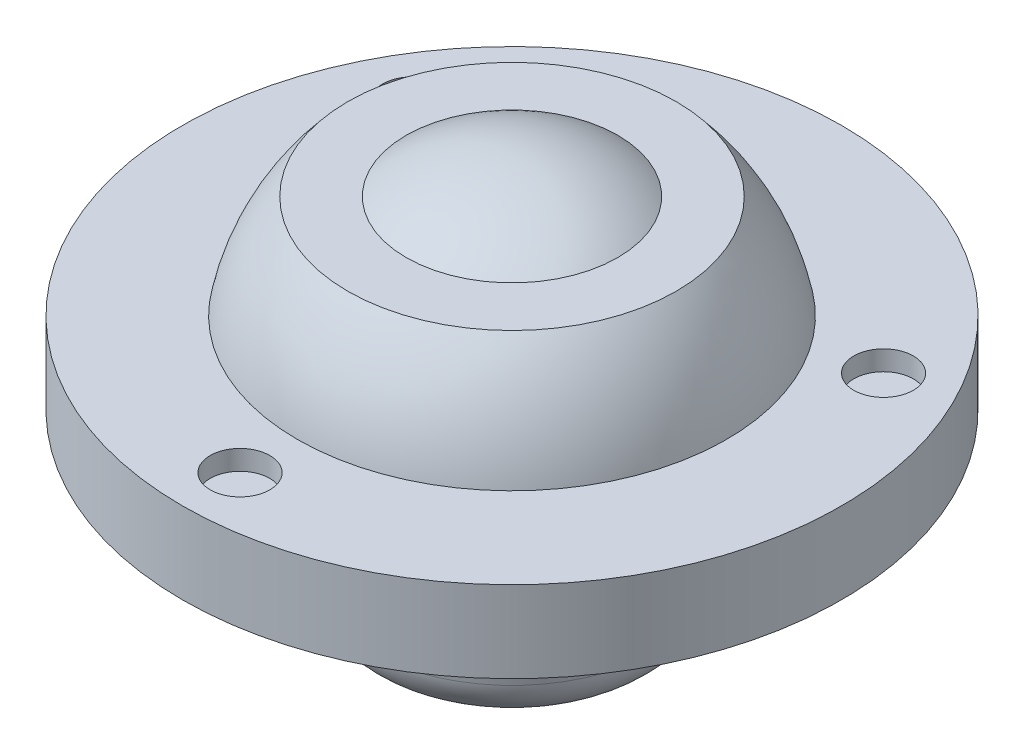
ISO-10303-21;
HEADER;
FILE_DESCRIPTION(('STEP AP214'),'2;1');
FILE_NAME('part.step','',(''),(''),'','','');
FILE_SCHEMA(('AUTOMOTIVE_DESIGN { 1 0 10303 214 1 1 1 1 }'));
ENDSEC;
DATA;
#1=APPLICATION_CONTEXT('core data for automotive mechanical design processes');
#2=APPLICATION_PROTOCOL_DEFINITION('international standard','automotive_design',2000,#1);
#3=PRODUCT_CONTEXT('',#1,'mechanical');
#4=PRODUCT('Part','Part','',(#3));
#5=PRODUCT_RELATED_PRODUCT_CATEGORY('part','',(#4));
#6=PRODUCT_DEFINITION_FORMATION('','',#4);
#7=PRODUCT_DEFINITION_CONTEXT('part definition',#1,'design');
#8=PRODUCT_DEFINITION('design','',#6,#7);
#9=PRODUCT_DEFINITION_SHAPE('','',#8);
#10=(LENGTH_UNIT() NAMED_UNIT(*) SI_UNIT(.MILLI.,.METRE.));
#11=(NAMED_UNIT(*) PLANE_ANGLE_UNIT() SI_UNIT($,.RADIAN.));
#12=(NAMED_UNIT(*) SI_UNIT($,.STERADIAN.) SOLID_ANGLE_UNIT());
#13=UNCERTAINTY_MEASURE_WITH_UNIT(LENGTH_MEASURE(1.E-05),#10,'distance_accuracy_value','');
#14=(GEOMETRIC_REPRESENTATION_CONTEXT(3) GLOBAL_UNCERTAINTY_ASSIGNED_CONTEXT((#13)) GLOBAL_UNIT_ASSIGNED_CONTEXT((#10,
#11,#12)) REPRESENTATION_CONTEXT('',''));
#15=CARTESIAN_POINT('',(0.,0.,0.));
#16=DIRECTION('',(0.,0.,1.));
#17=DIRECTION('',(1.,0.,0.));
#18=AXIS2_PLACEMENT_3D('',#15,#16,#17);
#19=CARTESIAN_POINT('',(0.,-11.,4.92833956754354));
#20=DIRECTION('',(0.,-1.,0.));
#21=DIRECTION('',(0.,0.,-1.));
#22=AXIS2_PLACEMENT_3D('',#19,#20,#21);
#23=PLANE('',#22);
#24=CARTESIAN_POINT('',(0.,-11.,0.));
#25=DIRECTION('',(0.,1.,0.));
#26=DIRECTION('',(0.,0.,1.));
#27=AXIS2_PLACEMENT_3D('',#24,#25,#26);
#28=CIRCLE('',#27,4.92833956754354);
#29=CARTESIAN_POINT('',(0.,-11.,4.92833956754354));
#30=VERTEX_POINT('',#29);
#31=EDGE_CURVE('E78',#30,#30,#28,.T.);
#32=ORIENTED_EDGE('',*,*,#31,.F.);
#33=EDGE_LOOP('',(#32));
#34=FACE_BOUND('',#33,.T.);
#35=ADVANCED_FACE('F30',(#34),#23,.T.);
#36=CARTESIAN_POINT('',(0.,0.,0.));
#37=DIRECTION('',(0.,1.,0.));
#38=DIRECTION('',(0.,0.,-1.));
#39=AXIS2_PLACEMENT_3D('',#36,#37,#38);
#40=SPHERICAL_SURFACE('',#39,9.);
#41=CARTESIAN_POINT('',(0.,7.24999999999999,0.));
#42=DIRECTION('',(0.,1.,0.));
#43=DIRECTION('',(0.,0.,1.));
#44=AXIS2_PLACEMENT_3D('',#41,#42,#43);
#45=CIRCLE('',#44,5.33268225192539);
#46=CARTESIAN_POINT('',(0.,7.24999999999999,5.33268225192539));
#47=VERTEX_POINT('',#46);
#48=EDGE_CURVE('E105',#47,#47,#45,.T.);
#49=ORIENTED_EDGE('',*,*,#48,.T.);
#50=EDGE_LOOP('',(#49));
#51=FACE_BOUND('',#50,.T.);
#52=ADVANCED_FACE('F188',(#51),#40,.T.);
#53=CARTESIAN_POINT('',(0.,7.25,7.806247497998));
#54=DIRECTION('',(0.,1.,0.));
#55=DIRECTION('',(0.,0.,1.));
#56=AXIS2_PLACEMENT_3D('',#53,#54,#55);
#57=PLANE('',#56);
#58=CARTESIAN_POINT('',(0.,7.24999999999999,0.));
#59=DIRECTION('',(0.,1.,0.));
#60=DIRECTION('',(0.,0.,1.));
#61=AXIS2_PLACEMENT_3D('',#58,#59,#60);
#62=CIRCLE('',#61,8.27269605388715);
#63=CARTESIAN_POINT('',(0.,7.24999999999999,8.27269605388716));
#64=VERTEX_POINT('',#63);
#65=EDGE_CURVE('E102',#64,#64,#62,.T.);
#66=ORIENTED_EDGE('',*,*,#65,.T.);
#67=EDGE_LOOP('',(#66));
#68=FACE_BOUND('',#67,.T.);
#69=ORIENTED_EDGE('',*,*,#48,.F.);
#70=EDGE_LOOP('',(#69));
#71=FACE_BOUND('',#70,.T.);
#72=ADVANCED_FACE('F193',(#68,#71),#57,.T.);
#73=CARTESIAN_POINT('',(0.,0.,0.));
#74=DIRECTION('',(0.,1.,0.));
#75=DIRECTION('',(0.,0.,1.));
#76=AXIS2_PLACEMENT_3D('',#73,#74,#75);
#77=SPHERICAL_SURFACE('',#76,11.);
#78=CARTESIAN_POINT('',(0.,2.05,0.));
#79=DIRECTION('',(0.,1.,0.));
#80=DIRECTION('',(0.,0.,1.));
#81=AXIS2_PLACEMENT_3D('',#78,#79,#80);
#82=CIRCLE('',#81,10.807289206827);
#83=CARTESIAN_POINT('',(0.,2.05,10.807289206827));
#84=VERTEX_POINT('',#83);
#85=EDGE_CURVE('E99',#84,#84,#82,.T.);
#86=CARTESIAN_POINT('',(0.,2.05,10.807289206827));
#87=CARTESIAN_POINT('',(0.,2.10990725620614,10.7959256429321));
#88=CARTESIAN_POINT('',(0.,2.16972000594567,10.7840638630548));
#89=CARTESIAN_POINT('',(0.,2.28913999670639,10.7593473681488));
#90=CARTESIAN_POINT('',(0.,2.34874723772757,10.7464926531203));
#91=CARTESIAN_POINT('',(0.,2.46773971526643,10.7197937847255));
#92=CARTESIAN_POINT('',(0.,2.52712495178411,10.7059496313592));
#93=CARTESIAN_POINT('',(0.,2.64565700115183,10.677275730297));
#94=CARTESIAN_POINT('',(0.,2.70480381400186,10.662445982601));
#95=CARTESIAN_POINT('',(0.,2.82284265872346,10.6318049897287));
#96=CARTESIAN_POINT('',(0.,2.88173469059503,10.6159937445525));
#97=CARTESIAN_POINT('',(0.,2.99924768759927,10.5833941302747));
#98=CARTESIAN_POINT('',(0.,3.05786865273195,10.5666057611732));
#99=CARTESIAN_POINT('',(0.,3.17482330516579,10.5320565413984));
#100=CARTESIAN_POINT('',(0.,3.23315699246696,10.5142956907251));
#101=CARTESIAN_POINT('',(0.,3.34952095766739,10.477806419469));
#102=CARTESIAN_POINT('',(0.,3.40755123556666,10.4590779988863));
#103=CARTESIAN_POINT('',(0.,3.52329233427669,10.4206587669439));
#104=CARTESIAN_POINT('',(0.,3.58100315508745,10.4009679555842));
#105=CARTESIAN_POINT('',(0.,3.69608938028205,10.360629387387));
#106=CARTESIAN_POINT('',(0.,3.7534647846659,10.3399816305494));
#107=CARTESIAN_POINT('',(0.,3.86786431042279,10.2977348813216));
#108=CARTESIAN_POINT('',(0.,3.92488843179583,10.2761358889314));
#109=CARTESIAN_POINT('',(0.,4.03856962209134,10.2319926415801));
#110=CARTESIAN_POINT('',(0.,4.09522669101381,10.209448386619));
#111=CARTESIAN_POINT('',(0.,4.20815810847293,10.1634208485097));
#112=CARTESIAN_POINT('',(0.,4.26443245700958,10.1399375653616));
#113=CARTESIAN_POINT('',(0.,4.37658287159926,10.0920384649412));
#114=CARTESIAN_POINT('',(0.,4.43245893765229,10.0676226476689));
#115=CARTESIAN_POINT('',(0.,4.54379733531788,10.0178652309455));
#116=CARTESIAN_POINT('',(0.,4.59925966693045,9.99252363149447));
#117=CARTESIAN_POINT('',(0.,4.70975525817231,9.94092165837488));
#118=CARTESIAN_POINT('',(0.,4.76478851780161,9.91466128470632));
#119=CARTESIAN_POINT('',(0.,4.87441074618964,9.86122902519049));
#120=CARTESIAN_POINT('',(0.,4.92899971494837,9.83405713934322));
#121=CARTESIAN_POINT('',(0.,5.03771826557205,9.77880936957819));
#122=CARTESIAN_POINT('',(0.,5.091847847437,9.75073348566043));
#123=CARTESIAN_POINT('',(0.,5.1996326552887,9.69368548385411));
#124=CARTESIAN_POINT('',(0.,5.25328788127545,9.66471336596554));
#125=CARTESIAN_POINT('',(0.,5.36010913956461,9.60588090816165));
#126=CARTESIAN_POINT('',(0.,5.41327517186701,9.57602056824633));
#127=CARTESIAN_POINT('',(0.,5.51910334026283,9.51541992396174));
#128=CARTESIAN_POINT('',(0.,5.57176547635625,9.48467961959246));
#129=CARTESIAN_POINT('',(0.,5.67657128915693,9.42232754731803));
#130=CARTESIAN_POINT('',(0.,5.72871496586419,9.39071577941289));
#131=CARTESIAN_POINT('',(0.,5.83246944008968,9.32662952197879));
#132=CARTESIAN_POINT('',(0.,5.88408023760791,9.29415503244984));
#133=CARTESIAN_POINT('',(0.,5.98675468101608,9.22835231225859));
#134=CARTESIAN_POINT('',(0.,6.03781832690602,9.19502408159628));
#135=CARTESIAN_POINT('',(0.,6.13938434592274,9.1275230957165));
#136=CARTESIAN_POINT('',(0.,6.18988671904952,9.09335034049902));
#137=CARTESIAN_POINT('',(0.,6.29031622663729,9.02416975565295));
#138=CARTESIAN_POINT('',(0.,6.34024336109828,8.98916192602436));
#139=CARTESIAN_POINT('',(0.,6.43950858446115,8.91832087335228));
#140=CARTESIAN_POINT('',(0.,6.48884667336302,8.88248765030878));
#141=CARTESIAN_POINT('',(0.,6.58692016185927,8.81000572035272));
#142=CARTESIAN_POINT('',(0.,6.63565556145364,8.77335701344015));
#143=CARTESIAN_POINT('',(0.,6.7325101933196,8.69925424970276));
#144=CARTESIAN_POINT('',(0.,6.7806294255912,8.66180019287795));
#145=CARTESIAN_POINT('',(0.,6.87623841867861,8.58609709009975));
#146=CARTESIAN_POINT('',(0.,6.92372817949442,8.54784804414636));
#147=CARTESIAN_POINT('',(0.,7.01806508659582,8.47056552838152));
#148=CARTESIAN_POINT('',(0.,7.0649122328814,8.43153205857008));
#149=CARTESIAN_POINT('',(0.,7.15795099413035,8.35269153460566));
#150=CARTESIAN_POINT('',(0.,7.20414260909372,8.31288448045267));
#151=CARTESIAN_POINT('',(0.,7.24999999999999,8.27269605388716));
#152=B_SPLINE_CURVE_WITH_KNOTS('',3,(#86,#87,#88,#89,#90,#91,#92,#93,#94,#95,#96,#97,#98,#99,
#100,#101,#102,#103,#104,#105,#106,#107,#108,#109,#110,#111,#112,#113,#114,#115,#116,#117,#118,
#119,#120,#121,#122,#123,#124,#125,#126,#127,#128,#129,#130,#131,#132,#133,#134,#135,#136,#137,
#138,#139,#140,#141,#142,#143,#144,#145,#146,#147,#148,#149,#150,#151),.UNSPECIFIED.,.F.,.F.,(4,
2,2,2,2,2,2,2,2,2,2,2,2,2,2,2,2,2,2,2,2,2,2,2,2,2,2,2,2,2,2,2,4),(0.,0.182924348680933,
0.365848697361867,0.548773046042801,0.731697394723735,0.914621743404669,1.0975460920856,
1.28047044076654,1.46339478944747,1.6463191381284,1.82924348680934,2.01216783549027,
2.19509218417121,2.37801653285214,2.56094088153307,2.74386523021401,2.92678957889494,
3.10971392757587,3.29263827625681,3.47556262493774,3.65848697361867,3.84141132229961,
4.02433567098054,4.20726001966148,4.39018436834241,4.57310871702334,4.75603306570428,
4.93895741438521,5.12188176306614,5.30480611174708,5.48773046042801,5.67065480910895,
5.85357915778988),.UNSPECIFIED.);
#153=EDGE_CURVE('BSEAM238',#84,#64,#152,.T.);
#154=ORIENTED_EDGE('',*,*,#85,.T.);
#155=ORIENTED_EDGE('',*,*,#65,.F.);
#156=ORIENTED_EDGE('',*,*,#153,.T.);
#157=ORIENTED_EDGE('',*,*,#153,.F.);
#158=EDGE_LOOP('',(#154,#156,#155,#157));
#159=FACE_BOUND('',#158,.T.);
#160=ADVANCED_FACE('F238',(#159),#77,.T.);
#161=CARTESIAN_POINT('',(0.,2.04999999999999,15.6));
#162=DIRECTION('',(0.,1.,0.));
#163=DIRECTION('',(0.,0.,1.));
#164=AXIS2_PLACEMENT_3D('',#161,#162,#163);
#165=PLANE('',#164);
#166=CARTESIAN_POINT('',(11.8645480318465,2.04999999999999,-6.85000000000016));
#167=DIRECTION('',(0.,1.,0.));
#168=DIRECTION('',(0.,0.,1.));
#169=AXIS2_PLACEMENT_3D('',#166,#167,#168);
#170=CIRCLE('',#169,1.50000000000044);
#171=CARTESIAN_POINT('',(11.8645480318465,2.04999999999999,-5.34999999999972));
#172=VERTEX_POINT('',#171);
#173=EDGE_CURVE('E275',#172,#172,#170,.T.);
#174=ORIENTED_EDGE('',*,*,#173,.F.);
#175=EDGE_LOOP('',(#174));
#176=FACE_BOUND('',#175,.T.);
#177=CARTESIAN_POINT('',(-11.8645480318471,2.04999999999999,-6.84999999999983));
#178=DIRECTION('',(0.,1.,0.));
#179=DIRECTION('',(0.,0.,1.));
#180=AXIS2_PLACEMENT_3D('',#177,#178,#179);
#181=CIRCLE('',#180,1.50000000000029);
#182=CARTESIAN_POINT('',(-11.8645480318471,2.04999999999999,-5.34999999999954));
#183=VERTEX_POINT('',#182);
#184=EDGE_CURVE('E53',#183,#183,#181,.T.);
#185=ORIENTED_EDGE('',*,*,#184,.F.);
#186=EDGE_LOOP('',(#185));
#187=FACE_BOUND('',#186,.T.);
#188=CARTESIAN_POINT('',(0.,2.04999999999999,13.7));
#189=DIRECTION('',(0.,1.,0.));
#190=DIRECTION('',(0.,0.,1.));
#191=AXIS2_PLACEMENT_3D('',#188,#189,#190);
#192=CIRCLE('',#191,1.5);
#193=CARTESIAN_POINT('',(0.,2.04999999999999,15.2));
#194=VERTEX_POINT('',#193);
#195=EDGE_CURVE('E49',#194,#194,#192,.T.);
#196=ORIENTED_EDGE('',*,*,#195,.F.);
#197=EDGE_LOOP('',(#196));
#198=FACE_BOUND('',#197,.T.);
#199=CARTESIAN_POINT('',(0.,2.04999999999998,0.));
#200=DIRECTION('',(0.,1.,0.));
#201=DIRECTION('',(0.,0.,1.));
#202=AXIS2_PLACEMENT_3D('',#199,#200,#201);
#203=CIRCLE('',#202,16.6);
#204=CARTESIAN_POINT('',(0.,2.04999999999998,16.6));
#205=VERTEX_POINT('',#204);
#206=EDGE_CURVE('E96',#205,#205,#203,.T.);
#207=ORIENTED_EDGE('',*,*,#206,.T.);
#208=EDGE_LOOP('',(#207));
#209=FACE_BOUND('',#208,.T.);
#210=ORIENTED_EDGE('',*,*,#85,.F.);
#211=EDGE_LOOP('',(#210));
#212=FACE_BOUND('',#211,.T.);
#213=ADVANCED_FACE('F232',(#176,#187,#198,#209,#212),#165,.T.);
#214=CARTESIAN_POINT('',(0.,80.398404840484,0.));
#215=DIRECTION('',(0.,1.,0.));
#216=DIRECTION('',(0.,0.,1.));
#217=AXIS2_PLACEMENT_3D('',#214,#215,#216);
#218=CYLINDRICAL_SURFACE('',#217,16.6);
#219=CARTESIAN_POINT('',(0.,-2.05,0.));
#220=DIRECTION('',(0.,1.,0.));
#221=DIRECTION('',(0.,0.,1.));
#222=AXIS2_PLACEMENT_3D('',#219,#220,#221);
#223=CIRCLE('',#222,16.6);
#224=CARTESIAN_POINT('',(0.,-2.05,16.6));
#225=VERTEX_POINT('',#224);
#226=EDGE_CURVE('E93',#225,#225,#223,.T.);
#227=ORIENTED_EDGE('',*,*,#226,.T.);
#228=EDGE_LOOP('',(#227));
#229=FACE_BOUND('',#228,.T.);
#230=ORIENTED_EDGE('',*,*,#206,.F.);
#231=EDGE_LOOP('',(#230));
#232=FACE_BOUND('',#231,.T.);
#233=ADVANCED_FACE('F225',(#229,#232),#218,.T.);
#234=CARTESIAN_POINT('',(0.,-2.05,15.6));
#235=DIRECTION('',(0.,-1.,0.));
#236=DIRECTION('',(0.,0.,-1.));
#237=AXIS2_PLACEMENT_3D('',#234,#235,#236);
#238=PLANE('',#237);
#239=CARTESIAN_POINT('',(11.8645480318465,-2.05,-6.85000000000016));
#240=DIRECTION('',(0.,-1.,0.));
#241=DIRECTION('',(0.,0.,-1.));
#242=AXIS2_PLACEMENT_3D('',#239,#240,#241);
#243=CIRCLE('',#242,1.50000000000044);
#244=CARTESIAN_POINT('',(11.8645480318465,-2.05,-8.35000000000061));
#245=VERTEX_POINT('',#244);
#246=EDGE_CURVE('E60',#245,#245,#243,.T.);
#247=ORIENTED_EDGE('',*,*,#246,.F.);
#248=EDGE_LOOP('',(#247));
#249=FACE_BOUND('',#248,.T.);
#250=CARTESIAN_POINT('',(-11.8645480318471,-2.05,-6.84999999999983));
#251=DIRECTION('',(0.,-1.,0.));
#252=DIRECTION('',(0.,0.,-1.));
#253=AXIS2_PLACEMENT_3D('',#250,#251,#252);
#254=CIRCLE('',#253,1.50000000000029);
#255=CARTESIAN_POINT('',(-11.8645480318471,-2.05,-8.35000000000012));
#256=VERTEX_POINT('',#255);
#257=EDGE_CURVE('E57',#256,#256,#254,.T.);
#258=ORIENTED_EDGE('',*,*,#257,.F.);
#259=EDGE_LOOP('',(#258));
#260=FACE_BOUND('',#259,.T.);
#261=CARTESIAN_POINT('',(0.,-2.05,13.7));
#262=DIRECTION('',(0.,-1.,0.));
#263=DIRECTION('',(0.,0.,-1.));
#264=AXIS2_PLACEMENT_3D('',#261,#262,#263);
#265=CIRCLE('',#264,1.5);
#266=CARTESIAN_POINT('',(0.,-2.05,12.2));
#267=VERTEX_POINT('',#266);
#268=EDGE_CURVE('E75',#267,#267,#265,.T.);
#269=ORIENTED_EDGE('',*,*,#268,.F.);
#270=EDGE_LOOP('',(#269));
#271=FACE_BOUND('',#270,.T.);
#272=CARTESIAN_POINT('',(0.,-2.05,0.));
#273=DIRECTION('',(0.,1.,0.));
#274=DIRECTION('',(0.,0.,1.));
#275=AXIS2_PLACEMENT_3D('',#272,#273,#274);
#276=CIRCLE('',#275,10.807289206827);
#277=CARTESIAN_POINT('',(0.,-2.05,10.807289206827));
#278=VERTEX_POINT('',#277);
#279=EDGE_CURVE('E90',#278,#278,#276,.T.);
#280=ORIENTED_EDGE('',*,*,#279,.T.);
#281=EDGE_LOOP('',(#280));
#282=FACE_BOUND('',#281,.T.);
#283=ORIENTED_EDGE('',*,*,#226,.F.);
#284=EDGE_LOOP('',(#283));
#285=FACE_BOUND('',#284,.T.);
#286=ADVANCED_FACE('F219',(#249,#260,#271,#282,#285),#238,.T.);
#287=CARTESIAN_POINT('',(0.,0.,0.));
#288=DIRECTION('',(0.,1.,0.));
#289=DIRECTION('',(0.,0.,1.));
#290=AXIS2_PLACEMENT_3D('',#287,#288,#289);
#291=SPHERICAL_SURFACE('',#290,11.);
#292=CARTESIAN_POINT('',(0.,-7.91144653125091,0.));
#293=DIRECTION('',(0.,1.,0.));
#294=DIRECTION('',(0.,0.,1.));
#295=AXIS2_PLACEMENT_3D('',#292,#293,#294);
#296=CIRCLE('',#295,7.64257900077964);
#297=CARTESIAN_POINT('',(0.,-7.91144653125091,7.64257900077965));
#298=VERTEX_POINT('',#297);
#299=EDGE_CURVE('E87',#298,#298,#296,.T.);
#300=CARTESIAN_POINT('',(0.,-7.91144653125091,7.64257900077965));
#301=CARTESIAN_POINT('',(0.,-7.86246858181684,7.69328013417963));
#302=CARTESIAN_POINT('',(0.,-7.81300312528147,7.74351032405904));
#303=CARTESIAN_POINT('',(0.,-7.71311576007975,7.84301053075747));
#304=CARTESIAN_POINT('',(0.,-7.66269385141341,7.8922805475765));
#305=CARTESIAN_POINT('',(0.,-7.5609121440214,7.98984212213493));
#306=CARTESIAN_POINT('',(0.,-7.50955234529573,8.03813367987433));
#307=CARTESIAN_POINT('',(0.,-7.40591386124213,8.13372050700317));
#308=CARTESIAN_POINT('',(0.,-7.3536351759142,8.18101577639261));
#309=CARTESIAN_POINT('',(0.,-7.24817823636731,8.2745925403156));
#310=CARTESIAN_POINT('',(0.,-7.19499998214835,8.32087403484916));
#311=CARTESIAN_POINT('',(0.,-7.08776356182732,8.41240614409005));
#312=CARTESIAN_POINT('',(0.,-7.03370539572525,8.45765675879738));
#313=CARTESIAN_POINT('',(0.,-6.92472913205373,8.54711038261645));
#314=CARTESIAN_POINT('',(0.,-6.86981103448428,8.59131339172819));
#315=CARTESIAN_POINT('',(0.,-6.75913520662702,8.67865546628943));
#316=CARTESIAN_POINT('',(0.,-6.70337747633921,8.72179453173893));
#317=CARTESIAN_POINT('',(0.,-6.59104299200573,8.80699277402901));
#318=CARTESIAN_POINT('',(0.,-6.53446623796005,8.84905195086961));
#319=CARTESIAN_POINT('',(0.,-6.42051461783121,8.93207487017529));
#320=CARTESIAN_POINT('',(0.,-6.36313975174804,8.97303861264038));
#321=CARTESIAN_POINT('',(0.,-6.24761311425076,9.05385552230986));
#322=CARTESIAN_POINT('',(0.,-6.18946134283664,9.09370868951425));
#323=CARTESIAN_POINT('',(0.,-6.07240238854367,9.17228971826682));
#324=CARTESIAN_POINT('',(0.,-6.01349520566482,9.211017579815));
#325=CARTESIAN_POINT('',(0.,-5.89494720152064,9.28733368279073));
#326=CARTESIAN_POINT('',(0.,-5.83530638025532,9.32492192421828));
#327=CARTESIAN_POINT('',(0.,-5.7153131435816,9.39894489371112));
#328=CARTESIAN_POINT('',(0.,-5.65496072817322,9.43537962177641));
#329=CARTESIAN_POINT('',(0.,-5.53356661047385,9.50708209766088));
#330=CARTESIAN_POINT('',(0.,-5.47252490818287,9.54234984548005));
#331=CARTESIAN_POINT('',(0.,-5.3497747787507,9.6117053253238));
#332=CARTESIAN_POINT('',(0.,-5.28806635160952,9.64579305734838));
#333=CARTESIAN_POINT('',(0.,-5.164005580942,9.71277590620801));
#334=CARTESIAN_POINT('',(0.,-5.10165323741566,9.74567102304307));
#335=CARTESIAN_POINT('',(0.,-4.97632768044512,9.81025648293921));
#336=CARTESIAN_POINT('',(0.,-4.91335446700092,9.84194682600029));
#337=CARTESIAN_POINT('',(0.,-4.78681044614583,9.90411102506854));
#338=CARTESIAN_POINT('',(0.,-4.72323963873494,9.93458488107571));
#339=CARTESIAN_POINT('',(0.,-4.59552392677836,9.99430484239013));
#340=CARTESIAN_POINT('',(0.,-4.53137902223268,10.0235509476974));
#341=CARTESIAN_POINT('',(0.,-4.40253882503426,10.0808045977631));
#342=CARTESIAN_POINT('',(0.,-4.33784353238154,10.1088121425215));
#343=CARTESIAN_POINT('',(0.,-4.2079264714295,10.1635783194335));
#344=CARTESIAN_POINT('',(0.,-4.14270470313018,10.1903369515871));
#345=CARTESIAN_POINT('',(0.,-4.01175879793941,10.2425954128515));
#346=CARTESIAN_POINT('',(0.,-3.94603466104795,10.2680952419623));
#347=CARTESIAN_POINT('',(0.,-3.81410831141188,10.3178266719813));
#348=CARTESIAN_POINT('',(0.,-3.74790609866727,10.3420582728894));
#349=CARTESIAN_POINT('',(0.,-3.61504806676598,10.3892442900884));
#350=CARTESIAN_POINT('',(0.,-3.5483922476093,10.4121987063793));
#351=CARTESIAN_POINT('',(0.,-3.41465163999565,10.4568218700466));
#352=CARTESIAN_POINT('',(0.,-3.34756685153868,10.4784906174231));
#353=CARTESIAN_POINT('',(0.,-3.21299310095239,10.5205344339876));
#354=CARTESIAN_POINT('',(0.,-3.14550413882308,10.5409095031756));
#355=CARTESIAN_POINT('',(0.,-3.01014698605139,10.5803584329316));
#356=CARTESIAN_POINT('',(0.,-2.94227879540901,10.5994322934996));
#357=CARTESIAN_POINT('',(0.,-2.80618827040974,10.6362717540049));
#358=CARTESIAN_POINT('',(0.,-2.73796593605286,10.6540373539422));
#359=CARTESIAN_POINT('',(0.,-2.6011923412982,10.6882537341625));
#360=CARTESIAN_POINT('',(0.,-2.53264108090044,10.7047045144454));
#361=CARTESIAN_POINT('',(0.,-2.39523496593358,10.7362851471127));
#362=CARTESIAN_POINT('',(0.,-2.32638011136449,10.7514149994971));
#363=CARTESIAN_POINT('',(0.,-2.18839227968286,10.7803482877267));
#364=CARTESIAN_POINT('',(0.,-2.11925930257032,10.7941517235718));
#365=CARTESIAN_POINT('',(0.,-2.05,10.807289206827));
#366=B_SPLINE_CURVE_WITH_KNOTS('',3,(#300,#301,#302,#303,#304,#305,#306,#307,#308,#309,#310,
#311,#312,#313,#314,#315,#316,#317,#318,#319,#320,#321,#322,#323,#324,#325,#326,#327,#328,#329,
#330,#331,#332,#333,#334,#335,#336,#337,#338,#339,#340,#341,#342,#343,#344,#345,#346,#347,#348,
#349,#350,#351,#352,#353,#354,#355,#356,#357,#358,#359,#360,#361,#362,#363,#364,#365),
.UNSPECIFIED.,.F.,.F.,(4,2,2,2,2,2,2,2,2,2,2,2,2,2,2,2,2,2,2,2,2,2,2,2,2,2,2,2,2,2,2,2,4),(0.,
0.211479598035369,0.422959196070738,0.634438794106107,0.845918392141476,1.05739799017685,
1.26887758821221,1.48035718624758,1.69183678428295,1.90331638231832,2.11479598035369,
2.32627557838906,2.53775517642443,2.7492347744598,2.96071437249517,3.17219397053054,
3.3836735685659,3.59515316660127,3.80663276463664,4.01811236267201,4.22959196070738,
4.44107155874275,4.65255115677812,4.86403075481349,5.07551035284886,5.28698995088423,
5.4984695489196,5.70994914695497,5.92142874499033,6.1329083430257,6.34438794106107,
6.55586753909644,6.76734713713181),.UNSPECIFIED.);
#367=EDGE_CURVE('BSEAM213',#298,#278,#366,.T.);
#368=ORIENTED_EDGE('',*,*,#299,.T.);
#369=ORIENTED_EDGE('',*,*,#279,.F.);
#370=ORIENTED_EDGE('',*,*,#367,.T.);
#371=ORIENTED_EDGE('',*,*,#367,.F.);
#372=EDGE_LOOP('',(#368,#370,#369,#371));
#373=FACE_BOUND('',#372,.T.);
#374=ADVANCED_FACE('F213',(#373),#291,.T.);
#375=CARTESIAN_POINT('',(0.,-8.27105773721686,0.));
#376=DIRECTION('',(0.,1.,0.));
#377=DIRECTION('',(0.,0.,1.));
#378=AXIS2_PLACEMENT_3D('',#375,#376,#377);
#379=TOROIDAL_SURFACE('',#378,7.98996895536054,0.499999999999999);
#380=CARTESIAN_POINT('',(0.,-8.20149302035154,0.));
#381=DIRECTION('',(0.,1.,0.));
#382=DIRECTION('',(0.,0.,1.));
#383=AXIS2_PLACEMENT_3D('',#380,#381,#382);
#384=CIRCLE('',#383,7.49483185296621);
#385=CARTESIAN_POINT('',(0.,-8.20149302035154,7.49483185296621));
#386=VERTEX_POINT('',#385);
#387=EDGE_CURVE('E84',#386,#386,#384,.T.);
#388=ORIENTED_EDGE('',*,*,#387,.T.);
#389=EDGE_LOOP('',(#388));
#390=FACE_BOUND('',#389,.T.);
#391=ORIENTED_EDGE('',*,*,#299,.F.);
#392=EDGE_LOOP('',(#391));
#393=FACE_BOUND('',#392,.T.);
#394=ADVANCED_FACE('F207',(#390,#393),#379,.F.);
#395=CARTESIAN_POINT('',(0.,-8.20149302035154,0.));
#396=DIRECTION('',(0.,1.,0.));
#397=DIRECTION('',(0.,0.,1.));
#398=AXIS2_PLACEMENT_3D('',#395,#396,#397);
#399=CONICAL_SURFACE('',#398,7.49483185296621,0.139582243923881);
#400=CARTESIAN_POINT('',(0.,-8.84782358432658,0.));
#401=DIRECTION('',(0.,1.,0.));
#402=DIRECTION('',(0.,0.,1.));
#403=AXIS2_PLACEMENT_3D('',#400,#401,#402);
#404=CIRCLE('',#403,7.40402507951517);
#405=CARTESIAN_POINT('',(0.,-8.84782358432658,7.40402507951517));
#406=VERTEX_POINT('',#405);
#407=EDGE_CURVE('E81',#406,#406,#404,.T.);
#408=ORIENTED_EDGE('',*,*,#407,.T.);
#409=EDGE_LOOP('',(#408));
#410=FACE_BOUND('',#409,.T.);
#411=ORIENTED_EDGE('',*,*,#387,.F.);
#412=EDGE_LOOP('',(#411));
#413=FACE_BOUND('',#412,.T.);
#414=ADVANCED_FACE('F201',(#410,#413),#399,.T.);
#415=CARTESIAN_POINT('',(0.,-8.50000000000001,0.));
#416=DIRECTION('',(0.,1.,0.));
#417=DIRECTION('',(0.,0.,1.));
#418=AXIS2_PLACEMENT_3D('',#415,#416,#417);
#419=TOROIDAL_SURFACE('',#418,4.92833956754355,2.5);
#420=ORIENTED_EDGE('',*,*,#31,.T.);
#421=EDGE_LOOP('',(#420));
#422=FACE_BOUND('',#421,.T.);
#423=ORIENTED_EDGE('',*,*,#407,.F.);
#424=EDGE_LOOP('',(#423));
#425=FACE_BOUND('',#424,.T.);
#426=ADVANCED_FACE('F197',(#422,#425),#419,.T.);
#427=CARTESIAN_POINT('',(0.,-7.95000000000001,13.7));
#428=DIRECTION('',(0.,1.,0.));
#429=DIRECTION('',(0.,0.,1.));
#430=AXIS2_PLACEMENT_3D('',#427,#428,#429);
#431=CYLINDRICAL_SURFACE('',#430,1.5);
#432=ORIENTED_EDGE('',*,*,#195,.T.);
#433=EDGE_LOOP('',(#432));
#434=FACE_BOUND('',#433,.T.);
#435=CARTESIAN_POINT('',(0.,1.05,13.7));
#436=DIRECTION('',(0.,1.,0.));
#437=DIRECTION('',(0.,0.,1.));
#438=AXIS2_PLACEMENT_3D('',#435,#436,#437);
#439=CIRCLE('',#438,1.5);
#440=CARTESIAN_POINT('',(0.,1.05,15.2));
#441=VERTEX_POINT('',#440);
#442=EDGE_CURVE('E46',#441,#441,#439,.T.);
#443=ORIENTED_EDGE('',*,*,#442,.F.);
#444=EDGE_LOOP('',(#443));
#445=FACE_BOUND('',#444,.T.);
#446=ADVANCED_FACE('F200',(#434,#445),#431,.F.);
#447=ORIENTED_EDGE('',*,*,#268,.T.);
#448=EDGE_LOOP('',(#447));
#449=FACE_BOUND('',#448,.T.);
#450=CARTESIAN_POINT('',(0.,-1.05,13.7));
#451=DIRECTION('',(0.,-1.,0.));
#452=DIRECTION('',(0.,0.,-1.));
#453=AXIS2_PLACEMENT_3D('',#450,#451,#452);
#454=CIRCLE('',#453,1.5);
#455=CARTESIAN_POINT('',(0.,-1.05,12.2));
#456=VERTEX_POINT('',#455);
#457=EDGE_CURVE('E48',#456,#456,#454,.T.);
#458=ORIENTED_EDGE('',*,*,#457,.F.);
#459=EDGE_LOOP('',(#458));
#460=FACE_BOUND('',#459,.T.);
#461=ADVANCED_FACE('F255',(#449,#460),#431,.F.);
#462=CARTESIAN_POINT('',(0.,-10.,4.92833956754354));
#463=DIRECTION('',(0.,-1.,0.));
#464=DIRECTION('',(0.,0.,-1.));
#465=AXIS2_PLACEMENT_3D('',#462,#463,#464);
#466=PLANE('',#465);
#467=CARTESIAN_POINT('',(0.,-9.99999999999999,0.));
#468=DIRECTION('',(0.,1.,0.));
#469=DIRECTION('',(0.,0.,1.));
#470=AXIS2_PLACEMENT_3D('',#467,#468,#469);
#471=CIRCLE('',#470,4.92833956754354);
#472=CARTESIAN_POINT('',(0.,-9.99999999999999,4.92833956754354));
#473=VERTEX_POINT('',#472);
#474=EDGE_CURVE('E10',#473,#473,#471,.T.);
#475=ORIENTED_EDGE('',*,*,#474,.T.);
#476=EDGE_LOOP('',(#475));
#477=FACE_BOUND('',#476,.T.);
#478=ADVANCED_FACE('F257',(#477),#466,.F.);
#479=CARTESIAN_POINT('',(0.,-8.50000000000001,0.));
#480=DIRECTION('',(0.,1.,0.));
#481=DIRECTION('',(0.,0.,1.));
#482=AXIS2_PLACEMENT_3D('',#479,#480,#481);
#483=TOROIDAL_SURFACE('',#482,4.92833956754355,1.5);
#484=ORIENTED_EDGE('',*,*,#474,.F.);
#485=EDGE_LOOP('',(#484));
#486=FACE_BOUND('',#485,.T.);
#487=CARTESIAN_POINT('',(0.,-8.70869415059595,0.));
#488=DIRECTION('',(0.,1.,0.));
#489=DIRECTION('',(0.,0.,1.));
#490=AXIS2_PLACEMENT_3D('',#487,#488,#489);
#491=CIRCLE('',#490,6.41375087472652);
#492=CARTESIAN_POINT('',(0.,-8.70869415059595,6.41375087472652));
#493=VERTEX_POINT('',#492);
#494=EDGE_CURVE('E37',#493,#493,#491,.T.);
#495=ORIENTED_EDGE('',*,*,#494,.T.);
#496=EDGE_LOOP('',(#495));
#497=FACE_BOUND('',#496,.T.);
#498=ADVANCED_FACE('F304',(#486,#497),#483,.F.);
#499=CARTESIAN_POINT('',(0.,-8.06236358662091,0.));
#500=DIRECTION('',(0.,1.,0.));
#501=DIRECTION('',(0.,0.,1.));
#502=AXIS2_PLACEMENT_3D('',#499,#500,#501);
#503=CONICAL_SURFACE('',#502,6.50455764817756,0.139582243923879);
#504=ORIENTED_EDGE('',*,*,#494,.F.);
#505=EDGE_LOOP('',(#504));
#506=FACE_BOUND('',#505,.T.);
#507=CARTESIAN_POINT('',(0.,-8.06236358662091,0.));
#508=DIRECTION('',(0.,1.,0.));
#509=DIRECTION('',(0.,0.,1.));
#510=AXIS2_PLACEMENT_3D('',#507,#508,#509);
#511=CIRCLE('',#510,6.50455764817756);
#512=CARTESIAN_POINT('',(0.,-8.06236358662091,6.50455764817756));
#513=VERTEX_POINT('',#512);
#514=EDGE_CURVE('E42',#513,#513,#511,.T.);
#515=ORIENTED_EDGE('',*,*,#514,.T.);
#516=EDGE_LOOP('',(#515));
#517=FACE_BOUND('',#516,.T.);
#518=ADVANCED_FACE('F131',(#506,#517),#503,.F.);
#519=CARTESIAN_POINT('',(0.,-8.27105773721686,0.));
#520=DIRECTION('',(0.,1.,0.));
#521=DIRECTION('',(0.,0.,1.));
#522=AXIS2_PLACEMENT_3D('',#519,#520,#521);
#523=TOROIDAL_SURFACE('',#522,7.98996895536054,1.5);
#524=ORIENTED_EDGE('',*,*,#514,.F.);
#525=EDGE_LOOP('',(#524));
#526=FACE_BOUND('',#525,.T.);
#527=CARTESIAN_POINT('',(0.,-7.19222411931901,0.));
#528=DIRECTION('',(0.,1.,0.));
#529=DIRECTION('',(0.,0.,1.));
#530=AXIS2_PLACEMENT_3D('',#527,#528,#529);
#531=CIRCLE('',#530,6.94779909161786);
#532=CARTESIAN_POINT('',(0.,-7.19222411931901,6.94779909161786));
#533=VERTEX_POINT('',#532);
#534=EDGE_CURVE('E126',#533,#533,#531,.T.);
#535=ORIENTED_EDGE('',*,*,#534,.T.);
#536=EDGE_LOOP('',(#535));
#537=FACE_BOUND('',#536,.T.);
#538=ADVANCED_FACE('F133',(#526,#537),#523,.T.);
#539=CARTESIAN_POINT('',(0.,0.,0.));
#540=DIRECTION('',(0.,1.,0.));
#541=DIRECTION('',(0.,0.,1.));
#542=AXIS2_PLACEMENT_3D('',#539,#540,#541);
#543=SPHERICAL_SURFACE('',#542,10.);
#544=CARTESIAN_POINT('',(0.,-1.05,0.));
#545=DIRECTION('',(0.,1.,0.));
#546=DIRECTION('',(0.,0.,1.));
#547=AXIS2_PLACEMENT_3D('',#544,#545,#546);
#548=CIRCLE('',#547,9.94472221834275);
#549=CARTESIAN_POINT('',(0.,-1.05,9.94472221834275));
#550=VERTEX_POINT('',#549);
#551=EDGE_CURVE('E123',#550,#550,#548,.T.);
#552=CARTESIAN_POINT('',(0.,-7.19222411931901,6.94779909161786));
#553=CARTESIAN_POINT('',(0.,-7.1417449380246,7.00005433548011));
#554=CARTESIAN_POINT('',(0.,-7.09069607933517,7.05175925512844));
#555=CARTESIAN_POINT('',(0.,-6.98748367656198,7.15404430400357));
#556=CARTESIAN_POINT('',(0.,-6.93532013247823,7.20462443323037));
#557=CARTESIAN_POINT('',(0.,-6.82990302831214,7.30463575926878));
#558=CARTESIAN_POINT('',(0.,-6.77664946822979,7.35406695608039));
#559=CARTESIAN_POINT('',(0.,-6.66907766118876,7.45175696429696));
#560=CARTESIAN_POINT('',(0.,-6.61475941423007,7.50001577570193));
#561=CARTESIAN_POINT('',(0.,-6.50508403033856,7.59533807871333));
#562=CARTESIAN_POINT('',(0.,-6.44972689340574,7.64240157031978));
#563=CARTESIAN_POINT('',(0.,-6.33800003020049,7.73531087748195));
#564=CARTESIAN_POINT('',(0.,-6.28163030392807,7.78115669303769));
#565=CARTESIAN_POINT('',(0.,-6.1679050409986,7.87160886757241));
#566=CARTESIAN_POINT('',(0.,-6.11054950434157,7.91621522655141));
#567=CARTESIAN_POINT('',(0.,-5.99487986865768,8.00416729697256));
#568=CARTESIAN_POINT('',(0.,-5.93656576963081,8.04751300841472));
#569=CARTESIAN_POINT('',(0.,-5.8190067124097,8.13292319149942));
#570=CARTESIAN_POINT('',(0.,-5.75976175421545,8.17498766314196));
#571=CARTESIAN_POINT('',(0.,-5.64036912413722,8.25781538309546));
#572=CARTESIAN_POINT('',(0.,-5.58022145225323,8.29857863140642));
#573=CARTESIAN_POINT('',(0.,-5.45905196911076,8.37878453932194));
#574=CARTESIAN_POINT('',(0.,-5.39803015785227,8.41822719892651));
#575=CARTESIAN_POINT('',(0.,-5.27514138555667,8.49577319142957));
#576=CARTESIAN_POINT('',(0.,-5.21327442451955,8.53387652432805));
#577=CARTESIAN_POINT('',(0.,-5.08872474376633,8.60872576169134));
#578=CARTESIAN_POINT('',(0.,-5.02604202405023,8.64547166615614));
#579=CARTESIAN_POINT('',(0.,-4.89989060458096,8.71758858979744));
#580=CARTESIAN_POINT('',(0.,-4.83642190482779,8.75295960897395));
#581=CARTESIAN_POINT('',(0.,-4.70872867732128,8.82230995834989));
#582=CARTESIAN_POINT('',(0.,-4.64450414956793,8.85628928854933));
#583=CARTESIAN_POINT('',(0.,-4.51532977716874,8.92284011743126));
#584=CARTESIAN_POINT('',(0.,-4.45037993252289,8.95541161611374));
#585=CARTESIAN_POINT('',(0.,-4.31978578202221,9.01913130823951));
#586=CARTESIAN_POINT('',(0.,-4.25414147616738,9.0502795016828));
#587=CARTESIAN_POINT('',(0.,-4.12218958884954,9.1111377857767));
#588=CARTESIAN_POINT('',(0.,-4.05588200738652,9.14084787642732));
#589=CARTESIAN_POINT('',(0.,-3.92263506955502,9.19881584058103));
#590=CARTESIAN_POINT('',(0.,-3.85569571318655,9.22707371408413));
#591=CARTESIAN_POINT('',(0.,-3.7212170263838,9.2821238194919));
#592=CARTESIAN_POINT('',(0.,-3.65367769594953,9.30891605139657));
#593=CARTESIAN_POINT('',(0.,-3.51803114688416,9.36102214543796));
#594=CARTESIAN_POINT('',(0.,-3.44992392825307,9.38633600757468));
#595=CARTESIAN_POINT('',(0.,-3.31317395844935,9.43547333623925));
#596=CARTESIAN_POINT('',(0.,-3.24453120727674,9.4592968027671));
#597=CARTESIAN_POINT('',(0.,-3.10674278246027,9.50544202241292));
#598=CARTESIAN_POINT('',(0.,-3.0375971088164,9.5277637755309));
#599=CARTESIAN_POINT('',(0.,-2.89883568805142,9.57089496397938));
#600=CARTESIAN_POINT('',(0.,-2.82921994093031,9.59170439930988));
#601=CARTESIAN_POINT('',(0.,-2.68955144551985,9.63180106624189));
#602=CARTESIAN_POINT('',(0.,-2.61949869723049,9.6510882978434));
#603=CARTESIAN_POINT('',(0.,-2.47898947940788,9.68813139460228));
#604=CARTESIAN_POINT('',(0.,-2.40853300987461,9.70588725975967));
#605=CARTESIAN_POINT('',(0.,-2.26724982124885,9.73985918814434));
#606=CARTESIAN_POINT('',(0.,-2.19642310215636,9.75607525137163));
#607=CARTESIAN_POINT('',(0.,-2.05443306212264,9.78695987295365));
#608=CARTESIAN_POINT('',(0.,-1.98326974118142,9.80162843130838));
#609=CARTESIAN_POINT('',(0.,-1.84064030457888,9.82941107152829));
#610=CARTESIAN_POINT('',(0.,-1.76917418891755,9.84252515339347));
#611=CARTESIAN_POINT('',(0.,-1.62597311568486,9.86719262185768));
#612=CARTESIAN_POINT('',(0.,-1.5542381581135,9.87874600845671));
#613=CARTESIAN_POINT('',(0.,-1.41053347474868,9.90028655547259));
#614=CARTESIAN_POINT('',(0.,-1.33856374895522,9.91027371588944));
#615=CARTESIAN_POINT('',(0.,-1.19442373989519,9.92867722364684));
#616=CARTESIAN_POINT('',(0.,-1.12225345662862,9.9370935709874));
#617=CARTESIAN_POINT('',(0.,-1.05,9.94472221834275));
#618=B_SPLINE_CURVE_WITH_KNOTS('',3,(#552,#553,#554,#555,#556,#557,#558,#559,#560,#561,#562,
#563,#564,#565,#566,#567,#568,#569,#570,#571,#572,#573,#574,#575,#576,#577,#578,#579,#580,#581,
#582,#583,#584,#585,#586,#587,#588,#589,#590,#591,#592,#593,#594,#595,#596,#597,#598,#599,#600,
#601,#602,#603,#604,#605,#606,#607,#608,#609,#610,#611,#612,#613,#614,#615,#616,#617),
.UNSPECIFIED.,.F.,.F.,(4,2,2,2,2,2,2,2,2,2,2,2,2,2,2,2,2,2,2,2,2,2,2,2,2,2,2,2,2,2,2,2,4),(0.,
0.217960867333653,0.435921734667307,0.65388260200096,0.871843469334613,1.08980433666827,
1.30776520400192,1.52572607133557,1.74368693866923,1.96164780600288,2.17960867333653,
2.39756954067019,2.61553040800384,2.83349127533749,3.05145214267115,3.2694130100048,
3.48737387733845,3.70533474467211,3.92329561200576,4.14125647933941,4.35921734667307,
4.57717821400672,4.79513908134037,5.01309994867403,5.23106081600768,5.44902168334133,
5.66698255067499,5.88494341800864,6.10290428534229,6.32086515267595,6.5388260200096,
6.75678688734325,6.97474775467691),.UNSPECIFIED.);
#619=EDGE_CURVE('BSEAM136',#533,#550,#618,.T.);
#620=ORIENTED_EDGE('',*,*,#534,.F.);
#621=ORIENTED_EDGE('',*,*,#551,.T.);
#622=ORIENTED_EDGE('',*,*,#619,.T.);
#623=ORIENTED_EDGE('',*,*,#619,.F.);
#624=EDGE_LOOP('',(#620,#622,#621,#623));
#625=FACE_BOUND('',#624,.T.);
#626=ADVANCED_FACE('F136',(#625),#543,.F.);
#627=CARTESIAN_POINT('',(0.,-1.05,15.6));
#628=DIRECTION('',(0.,-1.,0.));
#629=DIRECTION('',(0.,0.,-1.));
#630=AXIS2_PLACEMENT_3D('',#627,#628,#629);
#631=PLANE('',#630);
#632=CARTESIAN_POINT('',(11.8645480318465,-1.05,-6.85000000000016));
#633=DIRECTION('',(0.,-1.,0.));
#634=DIRECTION('',(0.,0.,-1.));
#635=AXIS2_PLACEMENT_3D('',#632,#633,#634);
#636=CIRCLE('',#635,1.50000000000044);
#637=CARTESIAN_POINT('',(11.8645480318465,-1.05,-8.35000000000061));
#638=VERTEX_POINT('',#637);
#639=EDGE_CURVE('E65',#638,#638,#636,.T.);
#640=ORIENTED_EDGE('',*,*,#639,.T.);
#641=EDGE_LOOP('',(#640));
#642=FACE_BOUND('',#641,.T.);
#643=CARTESIAN_POINT('',(-11.8645480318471,-1.05,-6.84999999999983));
#644=DIRECTION('',(0.,-1.,0.));
#645=DIRECTION('',(0.,0.,-1.));
#646=AXIS2_PLACEMENT_3D('',#643,#644,#645);
#647=CIRCLE('',#646,1.50000000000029);
#648=CARTESIAN_POINT('',(-11.8645480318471,-1.05,-8.35000000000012));
#649=VERTEX_POINT('',#648);
#650=EDGE_CURVE('E52',#649,#649,#647,.T.);
#651=ORIENTED_EDGE('',*,*,#650,.T.);
#652=EDGE_LOOP('',(#651));
#653=FACE_BOUND('',#652,.T.);
#654=ORIENTED_EDGE('',*,*,#457,.T.);
#655=EDGE_LOOP('',(#654));
#656=FACE_BOUND('',#655,.T.);
#657=ORIENTED_EDGE('',*,*,#551,.F.);
#658=EDGE_LOOP('',(#657));
#659=FACE_BOUND('',#658,.T.);
#660=CARTESIAN_POINT('',(0.,-1.05,0.));
#661=DIRECTION('',(0.,1.,0.));
#662=DIRECTION('',(0.,0.,1.));
#663=AXIS2_PLACEMENT_3D('',#660,#661,#662);
#664=CIRCLE('',#663,15.6);
#665=CARTESIAN_POINT('',(0.,-1.05,15.6));
#666=VERTEX_POINT('',#665);
#667=EDGE_CURVE('E120',#666,#666,#664,.T.);
#668=ORIENTED_EDGE('',*,*,#667,.T.);
#669=EDGE_LOOP('',(#668));
#670=FACE_BOUND('',#669,.T.);
#671=ADVANCED_FACE('F142',(#642,#653,#656,#659,#670),#631,.F.);
#672=CARTESIAN_POINT('',(0.,80.398404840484,0.));
#673=DIRECTION('',(0.,1.,0.));
#674=DIRECTION('',(0.,0.,1.));
#675=AXIS2_PLACEMENT_3D('',#672,#673,#674);
#676=CYLINDRICAL_SURFACE('',#675,15.6);
#677=ORIENTED_EDGE('',*,*,#667,.F.);
#678=EDGE_LOOP('',(#677));
#679=FACE_BOUND('',#678,.T.);
#680=CARTESIAN_POINT('',(0.,1.05,0.));
#681=DIRECTION('',(0.,1.,0.));
#682=DIRECTION('',(0.,0.,1.));
#683=AXIS2_PLACEMENT_3D('',#680,#681,#682);
#684=CIRCLE('',#683,15.6);
#685=CARTESIAN_POINT('',(0.,1.05,15.6));
#686=VERTEX_POINT('',#685);
#687=EDGE_CURVE('E117',#686,#686,#684,.T.);
#688=ORIENTED_EDGE('',*,*,#687,.T.);
#689=EDGE_LOOP('',(#688));
#690=FACE_BOUND('',#689,.T.);
#691=ADVANCED_FACE('F148',(#679,#690),#676,.F.);
#692=CARTESIAN_POINT('',(0.,1.05,15.6));
#693=DIRECTION('',(0.,1.,0.));
#694=DIRECTION('',(0.,0.,1.));
#695=AXIS2_PLACEMENT_3D('',#692,#693,#694);
#696=PLANE('',#695);
#697=CARTESIAN_POINT('',(11.8645480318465,1.05,-6.85000000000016));
#698=DIRECTION('',(0.,1.,0.));
#699=DIRECTION('',(0.,0.,1.));
#700=AXIS2_PLACEMENT_3D('',#697,#698,#699);
#701=CIRCLE('',#700,1.50000000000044);
#702=CARTESIAN_POINT('',(11.8645480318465,1.05,-5.34999999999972));
#703=VERTEX_POINT('',#702);
#704=EDGE_CURVE('E33',#703,#703,#701,.T.);
#705=ORIENTED_EDGE('',*,*,#704,.T.);
#706=EDGE_LOOP('',(#705));
#707=FACE_BOUND('',#706,.T.);
#708=CARTESIAN_POINT('',(-11.8645480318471,1.05,-6.84999999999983));
#709=DIRECTION('',(0.,1.,0.));
#710=DIRECTION('',(0.,0.,1.));
#711=AXIS2_PLACEMENT_3D('',#708,#709,#710);
#712=CIRCLE('',#711,1.50000000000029);
#713=CARTESIAN_POINT('',(-11.8645480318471,1.05,-5.34999999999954));
#714=VERTEX_POINT('',#713);
#715=EDGE_CURVE('E50',#714,#714,#712,.T.);
#716=ORIENTED_EDGE('',*,*,#715,.T.);
#717=EDGE_LOOP('',(#716));
#718=FACE_BOUND('',#717,.T.);
#719=ORIENTED_EDGE('',*,*,#442,.T.);
#720=EDGE_LOOP('',(#719));
#721=FACE_BOUND('',#720,.T.);
#722=ORIENTED_EDGE('',*,*,#687,.F.);
#723=EDGE_LOOP('',(#722));
#724=FACE_BOUND('',#723,.T.);
#725=CARTESIAN_POINT('',(0.,1.05,0.));
#726=DIRECTION('',(0.,1.,0.));
#727=DIRECTION('',(0.,0.,1.));
#728=AXIS2_PLACEMENT_3D('',#725,#726,#727);
#729=CIRCLE('',#728,9.94472221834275);
#730=CARTESIAN_POINT('',(0.,1.05,9.94472221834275));
#731=VERTEX_POINT('',#730);
#732=EDGE_CURVE('E114',#731,#731,#729,.T.);
#733=ORIENTED_EDGE('',*,*,#732,.T.);
#734=EDGE_LOOP('',(#733));
#735=FACE_BOUND('',#734,.T.);
#736=ADVANCED_FACE('F155',(#707,#718,#721,#724,#735),#696,.F.);
#737=CARTESIAN_POINT('',(0.,0.,0.));
#738=DIRECTION('',(0.,1.,0.));
#739=DIRECTION('',(0.,0.,1.));
#740=AXIS2_PLACEMENT_3D('',#737,#738,#739);
#741=SPHERICAL_SURFACE('',#740,10.);
#742=CARTESIAN_POINT('',(0.,6.25000000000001,0.));
#743=DIRECTION('',(0.,1.,0.));
#744=DIRECTION('',(0.,0.,1.));
#745=AXIS2_PLACEMENT_3D('',#742,#743,#744);
#746=CIRCLE('',#745,7.806247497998);
#747=CARTESIAN_POINT('',(0.,6.25000000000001,7.806247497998));
#748=VERTEX_POINT('',#747);
#749=EDGE_CURVE('E111',#748,#748,#746,.T.);
#750=CARTESIAN_POINT('',(0.,1.05,9.94472221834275));
#751=CARTESIAN_POINT('',(0.,1.10904033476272,9.93848858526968));
#752=CARTESIAN_POINT('',(0.,1.16802514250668,9.93172906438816));
#753=CARTESIAN_POINT('',(0.,1.28586502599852,9.91716065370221));
#754=CARTESIAN_POINT('',(0.,1.3447201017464,9.90935176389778));
#755=CARTESIAN_POINT('',(0.,1.46228184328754,9.89268702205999));
#756=CARTESIAN_POINT('',(0.,1.52098850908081,9.88383117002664));
#757=CARTESIAN_POINT('',(0.,1.63823481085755,9.86507533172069));
#758=CARTESIAN_POINT('',(0.,1.69677444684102,9.85517534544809));
#759=CARTESIAN_POINT('',(0.,1.8136681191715,9.83433437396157));
#760=CARTESIAN_POINT('',(0.,1.87202215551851,9.82339338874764));
#761=CARTESIAN_POINT('',(0.,1.98852611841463,9.80047389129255));
#762=CARTESIAN_POINT('',(0.,2.04667604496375,9.78849537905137));
#763=CARTESIAN_POINT('',(0.,2.16275334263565,9.76350462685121));
#764=CARTESIAN_POINT('',(0.,2.22068071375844,9.75049238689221));
#765=CARTESIAN_POINT('',(0.,2.33629452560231,9.7234383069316));
#766=CARTESIAN_POINT('',(0.,2.39398096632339,9.70939646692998));
#767=CARTESIAN_POINT('',(0.,2.50909461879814,9.68028764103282));
#768=CARTESIAN_POINT('',(0.,2.56652183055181,9.66522065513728));
#769=CARTESIAN_POINT('',(0.,2.68109880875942,9.6340663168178));
#770=CARTESIAN_POINT('',(0.,2.73824857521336,9.61797896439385));
#771=CARTESIAN_POINT('',(0.,2.85225253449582,9.58478899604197));
#772=CARTESIAN_POINT('',(0.,2.90910672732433,9.56768638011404));
#773=CARTESIAN_POINT('',(0.,3.02250150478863,9.53247130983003));
#774=CARTESIAN_POINT('',(0.,3.07904208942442,9.51435885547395));
#775=CARTESIAN_POINT('',(0.,3.19179171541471,9.477129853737));
#776=CARTESIAN_POINT('',(0.,3.24800075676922,9.45801330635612));
#777=CARTESIAN_POINT('',(0.,3.3600694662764,9.41878218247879));
#778=CARTESIAN_POINT('',(0.,3.41592913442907,9.39866760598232));
#779=CARTESIAN_POINT('',(0.,3.52728137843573,9.35744680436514));
#780=CARTESIAN_POINT('',(0.,3.58277395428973,9.33634057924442));
#781=CARTESIAN_POINT('',(0.,3.6933744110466,9.29314317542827));
#782=CARTESIAN_POINT('',(0.,3.74848229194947,9.27105199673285));
#783=CARTESIAN_POINT('',(0.,3.8582958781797,9.22589169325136));
#784=CARTESIAN_POINT('',(0.,3.91300158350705,9.2028225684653));
#785=CARTESIAN_POINT('',(0.,4.02199346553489,9.15571369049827));
#786=CARTESIAN_POINT('',(0.,4.07627964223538,9.13167393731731));
#787=CARTESIAN_POINT('',(0.,4.18441524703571,9.08263142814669));
#788=CARTESIAN_POINT('',(0.,4.23826467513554,9.05762867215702));
#789=CARTESIAN_POINT('',(0.,4.34550970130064,9.00666808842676));
#790=CARTESIAN_POINT('',(0.,4.39890529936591,8.98071026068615));
#791=CARTESIAN_POINT('',(0.,4.50522572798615,8.9278477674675));
#792=CARTESIAN_POINT('',(0.,4.55815055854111,8.90094310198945));
#793=CARTESIAN_POINT('',(0.,4.66351266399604,8.84619546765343));
#794=CARTESIAN_POINT('',(0.,4.71594993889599,8.81835249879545));
#795=CARTESIAN_POINT('',(0.,4.82032029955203,8.7617370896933));
#796=CARTESIAN_POINT('',(0.,4.8722533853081,8.73296464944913));
#797=CARTESIAN_POINT('',(0.,4.97559889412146,8.67449942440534));
#798=CARTESIAN_POINT('',(0.,5.02701131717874,8.64480663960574));
#799=CARTESIAN_POINT('',(0.,5.12929919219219,8.58451014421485));
#800=CARTESIAN_POINT('',(0.,5.18017464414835,8.55390643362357));
#801=CARTESIAN_POINT('',(0.,5.28137243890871,8.49179779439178));
#802=CARTESIAN_POINT('',(0.,5.33169478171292,8.46029286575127));
#803=CARTESIAN_POINT('',(0.,5.43177039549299,8.39639178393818));
#804=CARTESIAN_POINT('',(0.,5.48152366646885,8.36399563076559));
#805=CARTESIAN_POINT('',(0.,5.58044535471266,8.2983223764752));
#806=CARTESIAN_POINT('',(0.,5.6296137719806,8.26504527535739));
#807=CARTESIAN_POINT('',(0.,5.72735015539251,8.19762067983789));
#808=CARTESIAN_POINT('',(0.,5.77591812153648,8.16347318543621));
#809=CARTESIAN_POINT('',(0.,5.87243819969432,8.09431863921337));
#810=CARTESIAN_POINT('',(0.,5.92039031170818,8.05931158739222));
#811=CARTESIAN_POINT('',(0.,6.01566345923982,7.98844901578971));
#812=CARTESIAN_POINT('',(0.,6.0629844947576,7.95259349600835));
#813=CARTESIAN_POINT('',(0.,6.15698052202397,7.88004541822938));
#814=CARTESIAN_POINT('',(0.,6.20365551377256,7.84335286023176));
#815=CARTESIAN_POINT('',(0.,6.25000000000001,7.806247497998));
#816=B_SPLINE_CURVE_WITH_KNOTS('',3,(#750,#751,#752,#753,#754,#755,#756,#757,#758,#759,#760,
#761,#762,#763,#764,#765,#766,#767,#768,#769,#770,#771,#772,#773,#774,#775,#776,#777,#778,#779,
#780,#781,#782,#783,#784,#785,#786,#787,#788,#789,#790,#791,#792,#793,#794,#795,#796,#797,#798,
#799,#800,#801,#802,#803,#804,#805,#806,#807,#808,#809,#810,#811,#812,#813,#814,#815),
.UNSPECIFIED.,.F.,.F.,(4,2,2,2,2,2,2,2,2,2,2,2,2,2,2,2,2,2,2,2,2,2,2,2,2,2,2,2,2,2,2,2,4),(0.,
0.178103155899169,0.356206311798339,0.534309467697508,0.712412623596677,0.890515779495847,
1.06861893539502,1.24672209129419,1.42482524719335,1.60292840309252,1.78103155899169,
1.95913471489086,2.13723787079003,2.3153410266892,2.49344418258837,2.67154733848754,
2.84965049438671,3.02775365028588,3.20585680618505,3.38395996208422,3.56206311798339,
3.74016627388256,3.91826942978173,4.0963725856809,4.27447574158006,4.45257889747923,
4.6306820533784,4.80878520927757,4.98688836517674,5.16499152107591,5.34309467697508,
5.52119783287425,5.69930098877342),.UNSPECIFIED.);
#817=EDGE_CURVE('BSEAM161',#731,#748,#816,.T.);
#818=ORIENTED_EDGE('',*,*,#732,.F.);
#819=ORIENTED_EDGE('',*,*,#749,.T.);
#820=ORIENTED_EDGE('',*,*,#817,.T.);
#821=ORIENTED_EDGE('',*,*,#817,.F.);
#822=EDGE_LOOP('',(#818,#820,#819,#821));
#823=FACE_BOUND('',#822,.T.);
#824=ADVANCED_FACE('F161',(#823),#741,.F.);
#825=CARTESIAN_POINT('',(0.,6.25,7.806247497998));
#826=DIRECTION('',(0.,1.,0.));
#827=DIRECTION('',(0.,0.,1.));
#828=AXIS2_PLACEMENT_3D('',#825,#826,#827);
#829=PLANE('',#828);
#830=ORIENTED_EDGE('',*,*,#749,.F.);
#831=EDGE_LOOP('',(#830));
#832=FACE_BOUND('',#831,.T.);
#833=CARTESIAN_POINT('',(0.,6.25000000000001,0.));
#834=DIRECTION('',(0.,1.,0.));
#835=DIRECTION('',(0.,0.,1.));
#836=AXIS2_PLACEMENT_3D('',#833,#834,#835);
#837=CIRCLE('',#836,4.99374608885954);
#838=CARTESIAN_POINT('',(0.,6.25000000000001,4.99374608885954));
#839=VERTEX_POINT('',#838);
#840=EDGE_CURVE('E108',#839,#839,#837,.T.);
#841=ORIENTED_EDGE('',*,*,#840,.T.);
#842=EDGE_LOOP('',(#841));
#843=FACE_BOUND('',#842,.T.);
#844=ADVANCED_FACE('F168',(#832,#843),#829,.F.);
#845=CARTESIAN_POINT('',(0.,0.,0.));
#846=DIRECTION('',(0.,1.,0.));
#847=DIRECTION('',(0.,0.,-1.));
#848=AXIS2_PLACEMENT_3D('',#845,#846,#847);
#849=SPHERICAL_SURFACE('',#848,8.);
#850=ORIENTED_EDGE('',*,*,#840,.F.);
#851=EDGE_LOOP('',(#850));
#852=FACE_BOUND('',#851,.T.);
#853=ADVANCED_FACE('F174',(#852),#849,.F.);
#854=CARTESIAN_POINT('',(-11.8645480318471,-7.95000000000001,-6.84999999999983));
#855=DIRECTION('',(0.,1.,0.));
#856=DIRECTION('',(0.,0.,1.));
#857=AXIS2_PLACEMENT_3D('',#854,#855,#856);
#858=CYLINDRICAL_SURFACE('',#857,1.50000000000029);
#859=ORIENTED_EDGE('',*,*,#184,.T.);
#860=EDGE_LOOP('',(#859));
#861=FACE_BOUND('',#860,.T.);
#862=ORIENTED_EDGE('',*,*,#715,.F.);
#863=EDGE_LOOP('',(#862));
#864=FACE_BOUND('',#863,.T.);
#865=ADVANCED_FACE('F179',(#861,#864),#858,.F.);
#866=ORIENTED_EDGE('',*,*,#257,.T.);
#867=EDGE_LOOP('',(#866));
#868=FACE_BOUND('',#867,.T.);
#869=ORIENTED_EDGE('',*,*,#650,.F.);
#870=EDGE_LOOP('',(#869));
#871=FACE_BOUND('',#870,.T.);
#872=ADVANCED_FACE('F184',(#868,#871),#858,.F.);
#873=CARTESIAN_POINT('',(11.8645480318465,-7.95000000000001,-6.85000000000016));
#874=DIRECTION('',(0.,1.,0.));
#875=DIRECTION('',(0.,0.,1.));
#876=AXIS2_PLACEMENT_3D('',#873,#874,#875);
#877=CYLINDRICAL_SURFACE('',#876,1.50000000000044);
#878=ORIENTED_EDGE('',*,*,#173,.T.);
#879=EDGE_LOOP('',(#878));
#880=FACE_BOUND('',#879,.T.);
#881=ORIENTED_EDGE('',*,*,#704,.F.);
#882=EDGE_LOOP('',(#881));
#883=FACE_BOUND('',#882,.T.);
#884=ADVANCED_FACE('F261',(#880,#883),#877,.F.);
#885=ORIENTED_EDGE('',*,*,#246,.T.);
#886=EDGE_LOOP('',(#885));
#887=FACE_BOUND('',#886,.T.);
#888=ORIENTED_EDGE('',*,*,#639,.F.);
#889=EDGE_LOOP('',(#888));
#890=FACE_BOUND('',#889,.T.);
#891=ADVANCED_FACE('F263',(#887,#890),#877,.F.);
#892=CLOSED_SHELL('',(#35,#52,#72,#160,#213,#233,#286,#374,#394,#414,#426,#446,#461,#478,#498,
#518,#538,#626,#671,#691,#736,#824,#844,#853,#865,#872,#884,#891));
#893=MANIFOLD_SOLID_BREP('B2',#892);
#894=ADVANCED_BREP_SHAPE_REPRESENTATION('',(#18,#893),#14);
#895=SHAPE_DEFINITION_REPRESENTATION(#9,#894);
ENDSEC;
END-ISO-10303-21;
